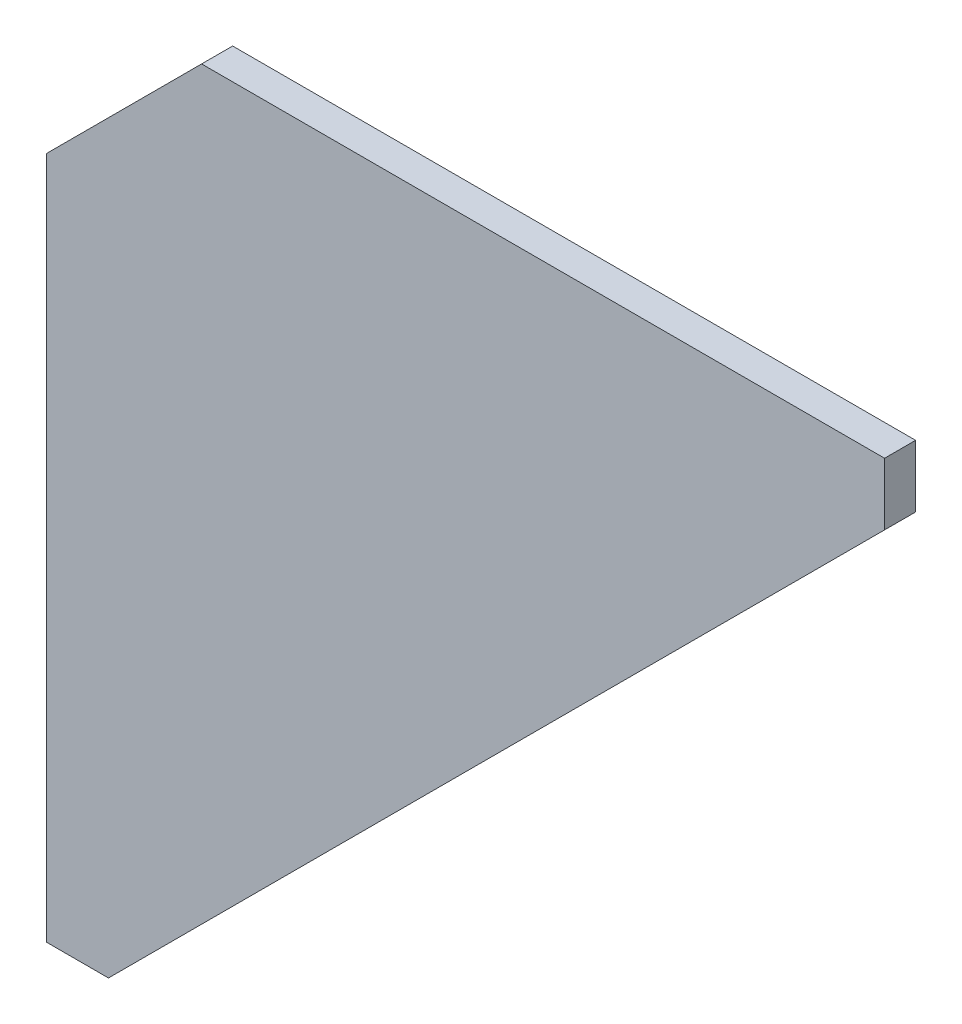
ISO-10303-21;
HEADER;
FILE_DESCRIPTION(('STEP AP214'),'2;1');
FILE_NAME('part.step','',(''),(''),'','','');
FILE_SCHEMA(('AUTOMOTIVE_DESIGN { 1 0 10303 214 1 1 1 1 }'));
ENDSEC;
DATA;
#1=APPLICATION_CONTEXT('core data for automotive mechanical design processes');
#2=APPLICATION_PROTOCOL_DEFINITION('international standard','automotive_design',2000,#1);
#3=PRODUCT_CONTEXT('',#1,'mechanical');
#4=PRODUCT('Part','Part','',(#3));
#5=PRODUCT_RELATED_PRODUCT_CATEGORY('part','',(#4));
#6=PRODUCT_DEFINITION_FORMATION('','',#4);
#7=PRODUCT_DEFINITION_CONTEXT('part definition',#1,'design');
#8=PRODUCT_DEFINITION('design','',#6,#7);
#9=PRODUCT_DEFINITION_SHAPE('','',#8);
#10=(LENGTH_UNIT() NAMED_UNIT(*) SI_UNIT(.MILLI.,.METRE.));
#11=(NAMED_UNIT(*) PLANE_ANGLE_UNIT() SI_UNIT($,.RADIAN.));
#12=(NAMED_UNIT(*) SI_UNIT($,.STERADIAN.) SOLID_ANGLE_UNIT());
#13=UNCERTAINTY_MEASURE_WITH_UNIT(LENGTH_MEASURE(1.E-05),#10,'distance_accuracy_value','');
#14=(GEOMETRIC_REPRESENTATION_CONTEXT(3) GLOBAL_UNCERTAINTY_ASSIGNED_CONTEXT((#13)) GLOBAL_UNIT_ASSIGNED_CONTEXT((#10,
#11,#12)) REPRESENTATION_CONTEXT('',''));
#15=CARTESIAN_POINT('',(0.,0.,0.));
#16=DIRECTION('',(0.,0.,1.));
#17=DIRECTION('',(1.,0.,0.));
#18=AXIS2_PLACEMENT_3D('',#15,#16,#17);
#19=CARTESIAN_POINT('',(270.000000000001,-3.46944695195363E-13,0.));
#20=DIRECTION('',(0.,0.,1.));
#21=DIRECTION('',(1.,0.,0.));
#22=AXIS2_PLACEMENT_3D('',#19,#20,#21);
#23=PLANE('',#22);
#24=DIRECTION('',(-0.707106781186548,-0.707106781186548,0.));
#25=VECTOR('',#24,1.);
#26=CARTESIAN_POINT('',(20.,0.,0.));
#27=LINE('',#26,#25);
#28=CARTESIAN_POINT('',(270.,250.,0.));
#29=VERTEX_POINT('',#28);
#30=CARTESIAN_POINT('',(20.,0.,0.));
#31=VERTEX_POINT('',#30);
#32=EDGE_CURVE('E102',#29,#31,#27,.T.);
#33=ORIENTED_EDGE('',*,*,#32,.T.);
#34=DIRECTION('',(-1.,0.,0.));
#35=VECTOR('',#34,1.);
#36=CARTESIAN_POINT('',(0.,0.,0.));
#37=LINE('',#36,#35);
#38=CARTESIAN_POINT('',(0.,0.,0.));
#39=VERTEX_POINT('',#38);
#40=EDGE_CURVE('E97',#31,#39,#37,.T.);
#41=ORIENTED_EDGE('',*,*,#40,.T.);
#42=DIRECTION('',(0.,1.,0.));
#43=VECTOR('',#42,1.);
#44=CARTESIAN_POINT('',(0.,220.,0.));
#45=LINE('',#44,#43);
#46=CARTESIAN_POINT('',(0.,220.,0.));
#47=VERTEX_POINT('',#46);
#48=EDGE_CURVE('E93',#39,#47,#45,.T.);
#49=ORIENTED_EDGE('',*,*,#48,.T.);
#50=DIRECTION('',(0.707106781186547,0.707106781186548,0.));
#51=VECTOR('',#50,1.);
#52=CARTESIAN_POINT('',(0.,220.,0.));
#53=LINE('',#52,#51);
#54=CARTESIAN_POINT('',(49.9999999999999,270.,0.));
#55=VERTEX_POINT('',#54);
#56=EDGE_CURVE('E80',#47,#55,#53,.T.);
#57=ORIENTED_EDGE('',*,*,#56,.T.);
#58=DIRECTION('',(1.,0.,0.));
#59=VECTOR('',#58,1.);
#60=CARTESIAN_POINT('',(49.9999999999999,270.,0.));
#61=LINE('',#60,#59);
#62=CARTESIAN_POINT('',(270.,270.,0.));
#63=VERTEX_POINT('',#62);
#64=EDGE_CURVE('E66',#55,#63,#61,.T.);
#65=ORIENTED_EDGE('',*,*,#64,.T.);
#66=DIRECTION('',(0.,-1.,0.));
#67=VECTOR('',#66,1.);
#68=CARTESIAN_POINT('',(270.,270.,0.));
#69=LINE('',#68,#67);
#70=EDGE_CURVE('E19',#63,#29,#69,.T.);
#71=ORIENTED_EDGE('',*,*,#70,.T.);
#72=EDGE_LOOP('',(#33,#41,#49,#57,#65,#71));
#73=FACE_BOUND('',#72,.T.);
#74=ADVANCED_FACE('F16',(#73),#23,.F.);
#75=CARTESIAN_POINT('',(270.,270.,10.));
#76=DIRECTION('',(-1.,0.,0.));
#77=DIRECTION('',(0.,-1.,0.));
#78=AXIS2_PLACEMENT_3D('',#75,#76,#77);
#79=PLANE('',#78);
#80=DIRECTION('',(0.,0.,-1.));
#81=VECTOR('',#80,1.);
#82=CARTESIAN_POINT('',(270.,270.,10.));
#83=LINE('',#82,#81);
#84=CARTESIAN_POINT('',(270.,270.,10.));
#85=VERTEX_POINT('',#84);
#86=EDGE_CURVE('E72',#63,#85,#83,.F.);
#87=ORIENTED_EDGE('',*,*,#86,.T.);
#88=DIRECTION('',(0.,1.,0.));
#89=VECTOR('',#88,1.);
#90=CARTESIAN_POINT('',(270.,-3.46944695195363E-13,10.));
#91=LINE('',#90,#89);
#92=CARTESIAN_POINT('',(270.,250.,10.));
#93=VERTEX_POINT('',#92);
#94=EDGE_CURVE('E104',#93,#85,#91,.T.);
#95=ORIENTED_EDGE('',*,*,#94,.F.);
#96=DIRECTION('',(0.,0.,1.));
#97=VECTOR('',#96,1.);
#98=CARTESIAN_POINT('',(270.,250.,10.));
#99=LINE('',#98,#97);
#100=EDGE_CURVE('E75',#93,#29,#99,.F.);
#101=ORIENTED_EDGE('',*,*,#100,.T.);
#102=ORIENTED_EDGE('',*,*,#70,.F.);
#103=EDGE_LOOP('',(#87,#95,#101,#102));
#104=FACE_BOUND('',#103,.T.);
#105=ADVANCED_FACE('F71',(#104),#79,.F.);
#106=CARTESIAN_POINT('',(49.9999999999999,270.,10.));
#107=DIRECTION('',(0.,-1.,0.));
#108=DIRECTION('',(0.,0.,-1.));
#109=AXIS2_PLACEMENT_3D('',#106,#107,#108);
#110=PLANE('',#109);
#111=DIRECTION('',(0.,0.,1.));
#112=VECTOR('',#111,1.);
#113=CARTESIAN_POINT('',(49.9999999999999,270.,10.));
#114=LINE('',#113,#112);
#115=CARTESIAN_POINT('',(49.9999999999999,270.,10.));
#116=VERTEX_POINT('',#115);
#117=EDGE_CURVE('E82',#55,#116,#114,.T.);
#118=ORIENTED_EDGE('',*,*,#117,.T.);
#119=DIRECTION('',(1.,0.,0.));
#120=VECTOR('',#119,1.);
#121=CARTESIAN_POINT('',(270.000000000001,270.,10.));
#122=LINE('',#121,#120);
#123=EDGE_CURVE('E86',#85,#116,#122,.F.);
#124=ORIENTED_EDGE('',*,*,#123,.F.);
#125=ORIENTED_EDGE('',*,*,#86,.F.);
#126=ORIENTED_EDGE('',*,*,#64,.F.);
#127=EDGE_LOOP('',(#118,#124,#125,#126));
#128=FACE_BOUND('',#127,.T.);
#129=ADVANCED_FACE('F84',(#128),#110,.F.);
#130=CARTESIAN_POINT('',(0.,220.,10.));
#131=DIRECTION('',(0.707106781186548,-0.707106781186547,0.));
#132=DIRECTION('',(0.707106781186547,0.707106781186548,0.));
#133=AXIS2_PLACEMENT_3D('',#130,#131,#132);
#134=PLANE('',#133);
#135=DIRECTION('',(0.,0.,1.));
#136=VECTOR('',#135,1.);
#137=CARTESIAN_POINT('',(0.,220.,10.));
#138=LINE('',#137,#136);
#139=CARTESIAN_POINT('',(0.,220.,10.));
#140=VERTEX_POINT('',#139);
#141=EDGE_CURVE('E91',#47,#140,#138,.T.);
#142=ORIENTED_EDGE('',*,*,#141,.T.);
#143=DIRECTION('',(-0.707106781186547,-0.707106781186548,0.));
#144=VECTOR('',#143,1.);
#145=CARTESIAN_POINT('',(49.9999999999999,270.,10.));
#146=LINE('',#145,#144);
#147=EDGE_CURVE('E107',#116,#140,#146,.T.);
#148=ORIENTED_EDGE('',*,*,#147,.F.);
#149=ORIENTED_EDGE('',*,*,#117,.F.);
#150=ORIENTED_EDGE('',*,*,#56,.F.);
#151=EDGE_LOOP('',(#142,#148,#149,#150));
#152=FACE_BOUND('',#151,.T.);
#153=ADVANCED_FACE('F135',(#152),#134,.F.);
#154=CARTESIAN_POINT('',(0.,220.,10.));
#155=DIRECTION('',(1.,0.,0.));
#156=DIRECTION('',(0.,1.,0.));
#157=AXIS2_PLACEMENT_3D('',#154,#155,#156);
#158=PLANE('',#157);
#159=DIRECTION('',(0.,0.,1.));
#160=VECTOR('',#159,1.);
#161=CARTESIAN_POINT('',(0.,0.,10.));
#162=LINE('',#161,#160);
#163=CARTESIAN_POINT('',(0.,0.,10.));
#164=VERTEX_POINT('',#163);
#165=EDGE_CURVE('E95',#39,#164,#162,.T.);
#166=ORIENTED_EDGE('',*,*,#165,.T.);
#167=DIRECTION('',(0.,1.,0.));
#168=VECTOR('',#167,1.);
#169=CARTESIAN_POINT('',(0.,-3.46944695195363E-13,10.));
#170=LINE('',#169,#168);
#171=EDGE_CURVE('E110',#140,#164,#170,.F.);
#172=ORIENTED_EDGE('',*,*,#171,.F.);
#173=ORIENTED_EDGE('',*,*,#141,.F.);
#174=ORIENTED_EDGE('',*,*,#48,.F.);
#175=EDGE_LOOP('',(#166,#172,#173,#174));
#176=FACE_BOUND('',#175,.T.);
#177=ADVANCED_FACE('F120',(#176),#158,.F.);
#178=CARTESIAN_POINT('',(0.,0.,10.));
#179=DIRECTION('',(0.,1.,0.));
#180=DIRECTION('',(-1.,0.,0.));
#181=AXIS2_PLACEMENT_3D('',#178,#179,#180);
#182=PLANE('',#181);
#183=DIRECTION('',(0.,0.,1.));
#184=VECTOR('',#183,1.);
#185=CARTESIAN_POINT('',(20.,0.,10.));
#186=LINE('',#185,#184);
#187=CARTESIAN_POINT('',(20.,0.,10.));
#188=VERTEX_POINT('',#187);
#189=EDGE_CURVE('E34',#31,#188,#186,.T.);
#190=ORIENTED_EDGE('',*,*,#189,.T.);
#191=DIRECTION('',(1.,0.,0.));
#192=VECTOR('',#191,1.);
#193=CARTESIAN_POINT('',(270.000000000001,0.,10.));
#194=LINE('',#193,#192);
#195=EDGE_CURVE('E25',#164,#188,#194,.T.);
#196=ORIENTED_EDGE('',*,*,#195,.F.);
#197=ORIENTED_EDGE('',*,*,#165,.F.);
#198=ORIENTED_EDGE('',*,*,#40,.F.);
#199=EDGE_LOOP('',(#190,#196,#197,#198));
#200=FACE_BOUND('',#199,.T.);
#201=ADVANCED_FACE('F118',(#200),#182,.F.);
#202=CARTESIAN_POINT('',(20.,0.,10.));
#203=DIRECTION('',(-0.707106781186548,0.707106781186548,0.));
#204=DIRECTION('',(-0.707106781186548,-0.707106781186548,0.));
#205=AXIS2_PLACEMENT_3D('',#202,#203,#204);
#206=PLANE('',#205);
#207=ORIENTED_EDGE('',*,*,#100,.F.);
#208=DIRECTION('',(0.707106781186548,0.707106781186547,0.));
#209=VECTOR('',#208,1.);
#210=CARTESIAN_POINT('',(20.,0.,10.));
#211=LINE('',#210,#209);
#212=EDGE_CURVE('E11',#188,#93,#211,.T.);
#213=ORIENTED_EDGE('',*,*,#212,.F.);
#214=ORIENTED_EDGE('',*,*,#189,.F.);
#215=ORIENTED_EDGE('',*,*,#32,.F.);
#216=EDGE_LOOP('',(#207,#213,#214,#215));
#217=FACE_BOUND('',#216,.T.);
#218=ADVANCED_FACE('F123',(#217),#206,.F.);
#219=CARTESIAN_POINT('',(270.000000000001,-3.46944695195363E-13,10.));
#220=DIRECTION('',(0.,0.,1.));
#221=DIRECTION('',(1.,0.,0.));
#222=AXIS2_PLACEMENT_3D('',#219,#220,#221);
#223=PLANE('',#222);
#224=ORIENTED_EDGE('',*,*,#195,.T.);
#225=ORIENTED_EDGE('',*,*,#212,.T.);
#226=ORIENTED_EDGE('',*,*,#94,.T.);
#227=ORIENTED_EDGE('',*,*,#123,.T.);
#228=ORIENTED_EDGE('',*,*,#147,.T.);
#229=ORIENTED_EDGE('',*,*,#171,.T.);
#230=EDGE_LOOP('',(#224,#225,#226,#227,#228,#229));
#231=FACE_BOUND('',#230,.T.);
#232=ADVANCED_FACE('F115',(#231),#223,.T.);
#233=CLOSED_SHELL('',(#74,#105,#129,#153,#177,#201,#218,#232));
#234=MANIFOLD_SOLID_BREP('B1',#233);
#235=ADVANCED_BREP_SHAPE_REPRESENTATION('',(#18,#234),#14);
#236=SHAPE_DEFINITION_REPRESENTATION(#9,#235);
ENDSEC;
END-ISO-10303-21;
